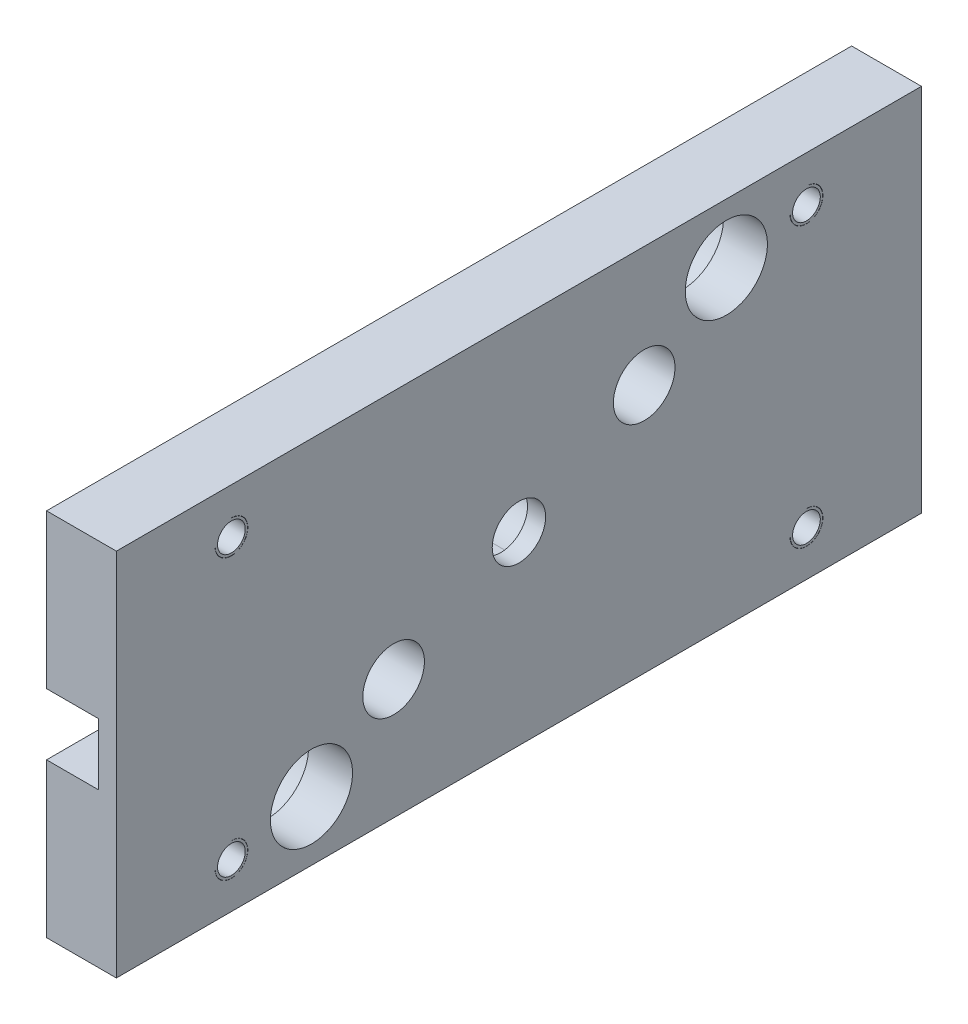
ISO-10303-21;
HEADER;
FILE_DESCRIPTION(('STEP AP214'),'2;1');
FILE_NAME('part.step','',(''),(''),'','','');
FILE_SCHEMA(('AUTOMOTIVE_DESIGN { 1 0 10303 214 1 1 1 1 }'));
ENDSEC;
DATA;
#1=APPLICATION_CONTEXT('core data for automotive mechanical design processes');
#2=APPLICATION_PROTOCOL_DEFINITION('international standard','automotive_design',2000,#1);
#3=PRODUCT_CONTEXT('',#1,'mechanical');
#4=PRODUCT('Part','Part','',(#3));
#5=PRODUCT_RELATED_PRODUCT_CATEGORY('part','',(#4));
#6=PRODUCT_DEFINITION_FORMATION('','',#4);
#7=PRODUCT_DEFINITION_CONTEXT('part definition',#1,'design');
#8=PRODUCT_DEFINITION('design','',#6,#7);
#9=PRODUCT_DEFINITION_SHAPE('','',#8);
#10=(LENGTH_UNIT() NAMED_UNIT(*) SI_UNIT(.MILLI.,.METRE.));
#11=(NAMED_UNIT(*) PLANE_ANGLE_UNIT() SI_UNIT($,.RADIAN.));
#12=(NAMED_UNIT(*) SI_UNIT($,.STERADIAN.) SOLID_ANGLE_UNIT());
#13=UNCERTAINTY_MEASURE_WITH_UNIT(LENGTH_MEASURE(1.E-05),#10,'distance_accuracy_value','');
#14=(GEOMETRIC_REPRESENTATION_CONTEXT(3) GLOBAL_UNCERTAINTY_ASSIGNED_CONTEXT((#13)) GLOBAL_UNIT_ASSIGNED_CONTEXT((#10,
#11,#12)) REPRESENTATION_CONTEXT('',''));
#15=CARTESIAN_POINT('',(0.,0.,0.));
#16=DIRECTION('',(0.,0.,1.));
#17=DIRECTION('',(1.,0.,0.));
#18=AXIS2_PLACEMENT_3D('',#15,#16,#17);
#19=CARTESIAN_POINT('',(-85.,0.,0.));
#20=DIRECTION('',(1.,0.,0.));
#21=DIRECTION('',(0.,0.,-1.));
#22=AXIS2_PLACEMENT_3D('',#19,#20,#21);
#23=PLANE('',#22);
#24=DIRECTION('',(0.,-1.,0.));
#25=VECTOR('',#24,1.);
#26=CARTESIAN_POINT('',(-85.0000000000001,45.,-98.0000000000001));
#27=LINE('',#26,#25);
#28=CARTESIAN_POINT('',(-85.0000000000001,45.,-98.0000000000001));
#29=VERTEX_POINT('',#28);
#30=CARTESIAN_POINT('',(-85.0000000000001,-45.,-98.0000000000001));
#31=VERTEX_POINT('',#30);
#32=EDGE_CURVE('E34',#29,#31,#27,.T.);
#33=ORIENTED_EDGE('',*,*,#32,.F.);
#34=DIRECTION('',(0.,0.,-1.));
#35=VECTOR('',#34,1.);
#36=CARTESIAN_POINT('',(-85.,45.,98.0000000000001));
#37=LINE('',#36,#35);
#38=CARTESIAN_POINT('',(-85.,45.,98.0000000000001));
#39=VERTEX_POINT('',#38);
#40=EDGE_CURVE('E323',#39,#29,#37,.T.);
#41=ORIENTED_EDGE('',*,*,#40,.F.);
#42=DIRECTION('',(0.,1.,0.));
#43=VECTOR('',#42,1.);
#44=CARTESIAN_POINT('',(-85.,-45.,98.0000000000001));
#45=LINE('',#44,#43);
#46=CARTESIAN_POINT('',(-85.,-45.,98.0000000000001));
#47=VERTEX_POINT('',#46);
#48=EDGE_CURVE('E317',#47,#39,#45,.T.);
#49=ORIENTED_EDGE('',*,*,#48,.F.);
#50=DIRECTION('',(0.,0.,1.));
#51=VECTOR('',#50,1.);
#52=CARTESIAN_POINT('',(-85.0000000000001,-45.,-98.0000000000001));
#53=LINE('',#52,#51);
#54=EDGE_CURVE('E435',#31,#47,#53,.T.);
#55=ORIENTED_EDGE('',*,*,#54,.F.);
#56=EDGE_LOOP('',(#33,#41,#49,#55));
#57=FACE_BOUND('',#56,.T.);
#58=CARTESIAN_POINT('',(-85.0000000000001,34.,-70.0000000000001));
#59=DIRECTION('',(-1.,0.,0.));
#60=DIRECTION('',(0.,0.,1.));
#61=AXIS2_PLACEMENT_3D('',#58,#59,#60);
#62=CIRCLE('',#61,3.375);
#63=CARTESIAN_POINT('',(-85.0000000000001,34.,-66.6250000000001));
#64=VERTEX_POINT('',#63);
#65=EDGE_CURVE('E9',#64,#64,#62,.T.);
#66=ORIENTED_EDGE('',*,*,#65,.T.);
#67=EDGE_LOOP('',(#66));
#68=FACE_BOUND('',#67,.T.);
#69=CARTESIAN_POINT('',(-85.0000000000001,34.,-70.0000000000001));
#70=DIRECTION('',(1.,0.,0.));
#71=DIRECTION('',(0.,1.,0.));
#72=AXIS2_PLACEMENT_3D('',#69,#70,#71);
#73=CIRCLE('',#72,3.95);
#74=CARTESIAN_POINT('',(-85.0000000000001,34.,-66.0500000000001));
#75=VERTEX_POINT('',#74);
#76=CARTESIAN_POINT('',(-85.0000000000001,37.95,-70.0000000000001));
#77=VERTEX_POINT('',#76);
#78=EDGE_CURVE('E25',#75,#77,#73,.T.);
#79=ORIENTED_EDGE('',*,*,#78,.T.);
#80=DIRECTION('',(0.,1.,0.));
#81=VECTOR('',#80,1.);
#82=CARTESIAN_POINT('',(-85.0000000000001,18.9875,-70.));
#83=LINE('',#82,#81);
#84=CARTESIAN_POINT('',(-85.0000000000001,38.,-70.0000000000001));
#85=VERTEX_POINT('',#84);
#86=EDGE_CURVE('E197',#77,#85,#83,.T.);
#87=ORIENTED_EDGE('',*,*,#86,.T.);
#88=CARTESIAN_POINT('',(-85.0000000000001,34.,-70.0000000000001));
#89=DIRECTION('',(-1.,0.,0.));
#90=DIRECTION('',(0.,1.,0.));
#91=AXIS2_PLACEMENT_3D('',#88,#89,#90);
#92=CIRCLE('',#91,4.);
#93=CARTESIAN_POINT('',(-85.0000000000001,34.,-66.0000000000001));
#94=VERTEX_POINT('',#93);
#95=EDGE_CURVE('E200',#85,#94,#92,.T.);
#96=ORIENTED_EDGE('',*,*,#95,.T.);
#97=DIRECTION('',(0.,0.,-1.));
#98=VECTOR('',#97,1.);
#99=CARTESIAN_POINT('',(-85.,34.,-33.0125));
#100=LINE('',#99,#98);
#101=EDGE_CURVE('E209',#94,#75,#100,.T.);
#102=ORIENTED_EDGE('',*,*,#101,.T.);
#103=EDGE_LOOP('',(#79,#87,#96,#102));
#104=FACE_BOUND('',#103,.T.);
#105=CARTESIAN_POINT('',(-85.,34.,70.0000000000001));
#106=DIRECTION('',(-1.,0.,0.));
#107=DIRECTION('',(0.,0.,1.));
#108=AXIS2_PLACEMENT_3D('',#105,#106,#107);
#109=CIRCLE('',#108,3.375);
#110=CARTESIAN_POINT('',(-85.,34.,73.3750000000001));
#111=VERTEX_POINT('',#110);
#112=EDGE_CURVE('E217',#111,#111,#109,.T.);
#113=ORIENTED_EDGE('',*,*,#112,.T.);
#114=EDGE_LOOP('',(#113));
#115=FACE_BOUND('',#114,.T.);
#116=DIRECTION('',(0.,0.,-1.));
#117=VECTOR('',#116,1.);
#118=CARTESIAN_POINT('',(-85.,34.,36.9875));
#119=LINE('',#118,#117);
#120=CARTESIAN_POINT('',(-85.,34.,74.0000000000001));
#121=VERTEX_POINT('',#120);
#122=CARTESIAN_POINT('',(-85.,34.,73.9500000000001));
#123=VERTEX_POINT('',#122);
#124=EDGE_CURVE('E353',#121,#123,#119,.T.);
#125=ORIENTED_EDGE('',*,*,#124,.T.);
#126=CARTESIAN_POINT('',(-85.,34.,70.0000000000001));
#127=DIRECTION('',(1.,0.,0.));
#128=DIRECTION('',(0.,1.,0.));
#129=AXIS2_PLACEMENT_3D('',#126,#127,#128);
#130=CIRCLE('',#129,3.95);
#131=CARTESIAN_POINT('',(-85.,37.95,70.));
#132=VERTEX_POINT('',#131);
#133=EDGE_CURVE('E369',#123,#132,#130,.T.);
#134=ORIENTED_EDGE('',*,*,#133,.T.);
#135=DIRECTION('',(0.,1.,0.));
#136=VECTOR('',#135,1.);
#137=CARTESIAN_POINT('',(-85.,18.9875,70.0000000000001));
#138=LINE('',#137,#136);
#139=CARTESIAN_POINT('',(-85.,38.,70.));
#140=VERTEX_POINT('',#139);
#141=EDGE_CURVE('E370',#132,#140,#138,.T.);
#142=ORIENTED_EDGE('',*,*,#141,.T.);
#143=CARTESIAN_POINT('',(-85.,34.,70.0000000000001));
#144=DIRECTION('',(-1.,0.,0.));
#145=DIRECTION('',(0.,1.,0.));
#146=AXIS2_PLACEMENT_3D('',#143,#144,#145);
#147=CIRCLE('',#146,4.);
#148=EDGE_CURVE('E357',#140,#121,#147,.T.);
#149=ORIENTED_EDGE('',*,*,#148,.T.);
#150=EDGE_LOOP('',(#125,#134,#142,#149));
#151=FACE_BOUND('',#150,.T.);
#152=CARTESIAN_POINT('',(-85.,-34.,70.0000000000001));
#153=DIRECTION('',(-1.,0.,0.));
#154=DIRECTION('',(0.,0.,1.));
#155=AXIS2_PLACEMENT_3D('',#152,#153,#154);
#156=CIRCLE('',#155,3.375);
#157=CARTESIAN_POINT('',(-85.,-34.,73.3750000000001));
#158=VERTEX_POINT('',#157);
#159=EDGE_CURVE('E358',#158,#158,#156,.T.);
#160=ORIENTED_EDGE('',*,*,#159,.T.);
#161=EDGE_LOOP('',(#160));
#162=FACE_BOUND('',#161,.T.);
#163=CARTESIAN_POINT('',(-85.,-34.,70.0000000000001));
#164=DIRECTION('',(1.,0.,0.));
#165=DIRECTION('',(0.,1.,0.));
#166=AXIS2_PLACEMENT_3D('',#163,#164,#165);
#167=CIRCLE('',#166,3.95);
#168=CARTESIAN_POINT('',(-85.,-34.,73.9500000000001));
#169=VERTEX_POINT('',#168);
#170=CARTESIAN_POINT('',(-85.,-30.05,70.0000000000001));
#171=VERTEX_POINT('',#170);
#172=EDGE_CURVE('E130',#169,#171,#167,.T.);
#173=ORIENTED_EDGE('',*,*,#172,.T.);
#174=DIRECTION('',(0.,1.,0.));
#175=VECTOR('',#174,1.);
#176=CARTESIAN_POINT('',(-85.,-15.0125,70.0000000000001));
#177=LINE('',#176,#175);
#178=CARTESIAN_POINT('',(-85.,-30.,70.0000000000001));
#179=VERTEX_POINT('',#178);
#180=EDGE_CURVE('E229',#171,#179,#177,.T.);
#181=ORIENTED_EDGE('',*,*,#180,.T.);
#182=CARTESIAN_POINT('',(-85.,-34.,70.0000000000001));
#183=DIRECTION('',(-1.,0.,0.));
#184=DIRECTION('',(0.,1.,0.));
#185=AXIS2_PLACEMENT_3D('',#182,#183,#184);
#186=CIRCLE('',#185,4.);
#187=CARTESIAN_POINT('',(-85.,-34.,74.0000000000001));
#188=VERTEX_POINT('',#187);
#189=EDGE_CURVE('E220',#179,#188,#186,.T.);
#190=ORIENTED_EDGE('',*,*,#189,.T.);
#191=DIRECTION('',(0.,0.,-1.));
#192=VECTOR('',#191,1.);
#193=CARTESIAN_POINT('',(-85.,-34.,36.9875));
#194=LINE('',#193,#192);
#195=EDGE_CURVE('E376',#188,#169,#194,.T.);
#196=ORIENTED_EDGE('',*,*,#195,.T.);
#197=EDGE_LOOP('',(#173,#181,#190,#196));
#198=FACE_BOUND('',#197,.T.);
#199=CARTESIAN_POINT('',(-85.0000000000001,-34.,-70.0000000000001));
#200=DIRECTION('',(-1.,0.,0.));
#201=DIRECTION('',(0.,0.,1.));
#202=AXIS2_PLACEMENT_3D('',#199,#200,#201);
#203=CIRCLE('',#202,3.375);
#204=CARTESIAN_POINT('',(-85.0000000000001,-34.,-66.6250000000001));
#205=VERTEX_POINT('',#204);
#206=EDGE_CURVE('E260',#205,#205,#203,.T.);
#207=ORIENTED_EDGE('',*,*,#206,.T.);
#208=EDGE_LOOP('',(#207));
#209=FACE_BOUND('',#208,.T.);
#210=CARTESIAN_POINT('',(-85.0000000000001,-34.,-70.0000000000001));
#211=DIRECTION('',(1.,0.,0.));
#212=DIRECTION('',(0.,1.,0.));
#213=AXIS2_PLACEMENT_3D('',#210,#211,#212);
#214=CIRCLE('',#213,3.95);
#215=CARTESIAN_POINT('',(-85.0000000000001,-34.,-66.0500000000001));
#216=VERTEX_POINT('',#215);
#217=CARTESIAN_POINT('',(-85.0000000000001,-30.05,-70.));
#218=VERTEX_POINT('',#217);
#219=EDGE_CURVE('E257',#216,#218,#214,.T.);
#220=ORIENTED_EDGE('',*,*,#219,.T.);
#221=DIRECTION('',(0.,1.,0.));
#222=VECTOR('',#221,1.);
#223=CARTESIAN_POINT('',(-85.0000000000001,-15.0125,-70.0000000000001));
#224=LINE('',#223,#222);
#225=CARTESIAN_POINT('',(-85.0000000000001,-30.,-70.));
#226=VERTEX_POINT('',#225);
#227=EDGE_CURVE('E261',#218,#226,#224,.T.);
#228=ORIENTED_EDGE('',*,*,#227,.T.);
#229=CARTESIAN_POINT('',(-85.0000000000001,-34.,-70.0000000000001));
#230=DIRECTION('',(-1.,0.,0.));
#231=DIRECTION('',(0.,1.,0.));
#232=AXIS2_PLACEMENT_3D('',#229,#230,#231);
#233=CIRCLE('',#232,4.);
#234=CARTESIAN_POINT('',(-85.0000000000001,-34.,-66.0000000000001));
#235=VERTEX_POINT('',#234);
#236=EDGE_CURVE('E170',#226,#235,#233,.T.);
#237=ORIENTED_EDGE('',*,*,#236,.T.);
#238=DIRECTION('',(0.,0.,-1.));
#239=VECTOR('',#238,1.);
#240=CARTESIAN_POINT('',(-85.,-34.,-33.0125));
#241=LINE('',#240,#239);
#242=EDGE_CURVE('E166',#235,#216,#241,.T.);
#243=ORIENTED_EDGE('',*,*,#242,.T.);
#244=EDGE_LOOP('',(#220,#228,#237,#243));
#245=FACE_BOUND('',#244,.T.);
#246=CARTESIAN_POINT('',(-85.,15.75,-30.5));
#247=DIRECTION('',(-1.,0.,0.));
#248=DIRECTION('',(0.,0.,1.));
#249=AXIS2_PLACEMENT_3D('',#246,#247,#248);
#250=CIRCLE('',#249,7.5);
#251=CARTESIAN_POINT('',(-85.,15.75,-23.));
#252=VERTEX_POINT('',#251);
#253=EDGE_CURVE('E171',#252,#252,#250,.T.);
#254=ORIENTED_EDGE('',*,*,#253,.T.);
#255=EDGE_LOOP('',(#254));
#256=FACE_BOUND('',#255,.T.);
#257=CARTESIAN_POINT('',(-85.,-15.75,30.5));
#258=DIRECTION('',(-1.,0.,0.));
#259=DIRECTION('',(0.,0.,1.));
#260=AXIS2_PLACEMENT_3D('',#257,#258,#259);
#261=CIRCLE('',#260,7.5);
#262=CARTESIAN_POINT('',(-85.,-15.75,38.));
#263=VERTEX_POINT('',#262);
#264=EDGE_CURVE('E403',#263,#263,#261,.T.);
#265=ORIENTED_EDGE('',*,*,#264,.T.);
#266=EDGE_LOOP('',(#265));
#267=FACE_BOUND('',#266,.T.);
#268=CARTESIAN_POINT('',(-85.,30.5,-50.5000000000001));
#269=DIRECTION('',(-1.,0.,0.));
#270=DIRECTION('',(0.,0.,1.));
#271=AXIS2_PLACEMENT_3D('',#268,#269,#270);
#272=CIRCLE('',#271,10.);
#273=CARTESIAN_POINT('',(-85.,30.5,-40.5000000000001));
#274=VERTEX_POINT('',#273);
#275=EDGE_CURVE('E346',#274,#274,#272,.T.);
#276=ORIENTED_EDGE('',*,*,#275,.T.);
#277=EDGE_LOOP('',(#276));
#278=FACE_BOUND('',#277,.T.);
#279=CARTESIAN_POINT('',(-85.,-30.5,50.5000000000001));
#280=DIRECTION('',(-1.,0.,0.));
#281=DIRECTION('',(0.,0.,1.));
#282=AXIS2_PLACEMENT_3D('',#279,#280,#281);
#283=CIRCLE('',#282,10.);
#284=CARTESIAN_POINT('',(-85.,-30.5,60.5000000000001));
#285=VERTEX_POINT('',#284);
#286=EDGE_CURVE('E342',#285,#285,#283,.T.);
#287=ORIENTED_EDGE('',*,*,#286,.T.);
#288=EDGE_LOOP('',(#287));
#289=FACE_BOUND('',#288,.T.);
#290=CARTESIAN_POINT('',(-85.,0.,0.));
#291=DIRECTION('',(-1.,0.,0.));
#292=DIRECTION('',(0.,0.,1.));
#293=AXIS2_PLACEMENT_3D('',#290,#291,#292);
#294=CIRCLE('',#293,6.5);
#295=CARTESIAN_POINT('',(-85.,0.,6.50000000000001));
#296=VERTEX_POINT('',#295);
#297=EDGE_CURVE('E280',#296,#296,#294,.T.);
#298=ORIENTED_EDGE('',*,*,#297,.T.);
#299=EDGE_LOOP('',(#298));
#300=FACE_BOUND('',#299,.T.);
#301=ADVANCED_FACE('F14',(#57,#68,#104,#115,#151,#162,#198,#209,#245,#256,#267,#278,#289,#300),
#23,.T.);
#302=CARTESIAN_POINT('',(-102.,0.,0.));
#303=DIRECTION('',(-1.,0.,0.));
#304=DIRECTION('',(0.,0.,1.));
#305=AXIS2_PLACEMENT_3D('',#302,#303,#304);
#306=PLANE('',#305);
#307=CARTESIAN_POINT('',(-102.,34.,-70.0000000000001));
#308=DIRECTION('',(1.,0.,0.));
#309=DIRECTION('',(0.,0.,1.));
#310=AXIS2_PLACEMENT_3D('',#307,#308,#309);
#311=CIRCLE('',#310,3.375);
#312=CARTESIAN_POINT('',(-102.,34.,-66.6250000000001));
#313=VERTEX_POINT('',#312);
#314=EDGE_CURVE('E276',#313,#313,#311,.T.);
#315=ORIENTED_EDGE('',*,*,#314,.T.);
#316=EDGE_LOOP('',(#315));
#317=FACE_BOUND('',#316,.T.);
#318=CARTESIAN_POINT('',(-102.,34.,-70.0000000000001));
#319=DIRECTION('',(-1.,0.,0.));
#320=DIRECTION('',(0.,1.,0.));
#321=AXIS2_PLACEMENT_3D('',#318,#319,#320);
#322=CIRCLE('',#321,3.95);
#323=CARTESIAN_POINT('',(-102.,37.95,-70.0000000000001));
#324=VERTEX_POINT('',#323);
#325=CARTESIAN_POINT('',(-102.,34.,-66.0500000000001));
#326=VERTEX_POINT('',#325);
#327=EDGE_CURVE('E195',#324,#326,#322,.T.);
#328=ORIENTED_EDGE('',*,*,#327,.T.);
#329=DIRECTION('',(0.,0.,1.));
#330=VECTOR('',#329,1.);
#331=CARTESIAN_POINT('',(-102.,34.,-33.0125));
#332=LINE('',#331,#330);
#333=CARTESIAN_POINT('',(-102.,34.,-66.0000000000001));
#334=VERTEX_POINT('',#333);
#335=EDGE_CURVE('E192',#326,#334,#332,.T.);
#336=ORIENTED_EDGE('',*,*,#335,.T.);
#337=CARTESIAN_POINT('',(-102.,34.,-70.0000000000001));
#338=DIRECTION('',(1.,0.,0.));
#339=DIRECTION('',(0.,1.,0.));
#340=AXIS2_PLACEMENT_3D('',#337,#338,#339);
#341=CIRCLE('',#340,4.);
#342=CARTESIAN_POINT('',(-102.,38.,-70.0000000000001));
#343=VERTEX_POINT('',#342);
#344=EDGE_CURVE('E196',#334,#343,#341,.T.);
#345=ORIENTED_EDGE('',*,*,#344,.T.);
#346=DIRECTION('',(0.,-1.,0.));
#347=VECTOR('',#346,1.);
#348=CARTESIAN_POINT('',(-102.,18.9875,-70.));
#349=LINE('',#348,#347);
#350=EDGE_CURVE('E335',#343,#324,#349,.T.);
#351=ORIENTED_EDGE('',*,*,#350,.T.);
#352=EDGE_LOOP('',(#328,#336,#345,#351));
#353=FACE_BOUND('',#352,.T.);
#354=CARTESIAN_POINT('',(-102.,34.,70.0000000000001));
#355=DIRECTION('',(1.,0.,0.));
#356=DIRECTION('',(0.,0.,1.));
#357=AXIS2_PLACEMENT_3D('',#354,#355,#356);
#358=CIRCLE('',#357,3.375);
#359=CARTESIAN_POINT('',(-102.,34.,73.3750000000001));
#360=VERTEX_POINT('',#359);
#361=EDGE_CURVE('E331',#360,#360,#358,.T.);
#362=ORIENTED_EDGE('',*,*,#361,.T.);
#363=EDGE_LOOP('',(#362));
#364=FACE_BOUND('',#363,.T.);
#365=CARTESIAN_POINT('',(-102.,34.,70.0000000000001));
#366=DIRECTION('',(-1.,0.,0.));
#367=DIRECTION('',(0.,1.,0.));
#368=AXIS2_PLACEMENT_3D('',#365,#366,#367);
#369=CIRCLE('',#368,3.95);
#370=CARTESIAN_POINT('',(-102.,37.95,70.0000000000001));
#371=VERTEX_POINT('',#370);
#372=CARTESIAN_POINT('',(-102.,34.,73.9500000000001));
#373=VERTEX_POINT('',#372);
#374=EDGE_CURVE('E288',#371,#373,#369,.T.);
#375=ORIENTED_EDGE('',*,*,#374,.T.);
#376=DIRECTION('',(0.,0.,1.));
#377=VECTOR('',#376,1.);
#378=CARTESIAN_POINT('',(-102.,34.,36.9875));
#379=LINE('',#378,#377);
#380=CARTESIAN_POINT('',(-102.,34.,74.0000000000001));
#381=VERTEX_POINT('',#380);
#382=EDGE_CURVE('E284',#373,#381,#379,.T.);
#383=ORIENTED_EDGE('',*,*,#382,.T.);
#384=CARTESIAN_POINT('',(-102.,34.,70.0000000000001));
#385=DIRECTION('',(1.,0.,0.));
#386=DIRECTION('',(0.,1.,0.));
#387=AXIS2_PLACEMENT_3D('',#384,#385,#386);
#388=CIRCLE('',#387,4.);
#389=CARTESIAN_POINT('',(-102.,38.,70.0000000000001));
#390=VERTEX_POINT('',#389);
#391=EDGE_CURVE('E289',#381,#390,#388,.T.);
#392=ORIENTED_EDGE('',*,*,#391,.T.);
#393=DIRECTION('',(0.,-1.,0.));
#394=VECTOR('',#393,1.);
#395=CARTESIAN_POINT('',(-102.,18.9875,70.0000000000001));
#396=LINE('',#395,#394);
#397=EDGE_CURVE('E302',#390,#371,#396,.T.);
#398=ORIENTED_EDGE('',*,*,#397,.T.);
#399=EDGE_LOOP('',(#375,#383,#392,#398));
#400=FACE_BOUND('',#399,.T.);
#401=CARTESIAN_POINT('',(-102.,-34.,70.0000000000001));
#402=DIRECTION('',(1.,0.,0.));
#403=DIRECTION('',(0.,0.,1.));
#404=AXIS2_PLACEMENT_3D('',#401,#402,#403);
#405=CIRCLE('',#404,3.375);
#406=CARTESIAN_POINT('',(-102.,-34.,73.3750000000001));
#407=VERTEX_POINT('',#406);
#408=EDGE_CURVE('E149',#407,#407,#405,.T.);
#409=ORIENTED_EDGE('',*,*,#408,.T.);
#410=EDGE_LOOP('',(#409));
#411=FACE_BOUND('',#410,.T.);
#412=DIRECTION('',(0.,-1.,0.));
#413=VECTOR('',#412,1.);
#414=CARTESIAN_POINT('',(-102.,-15.0125,70.0000000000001));
#415=LINE('',#414,#413);
#416=CARTESIAN_POINT('',(-102.,-30.,70.0000000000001));
#417=VERTEX_POINT('',#416);
#418=CARTESIAN_POINT('',(-102.,-30.05,70.0000000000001));
#419=VERTEX_POINT('',#418);
#420=EDGE_CURVE('E147',#417,#419,#415,.T.);
#421=ORIENTED_EDGE('',*,*,#420,.T.);
#422=CARTESIAN_POINT('',(-102.,-34.,70.0000000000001));
#423=DIRECTION('',(-1.,0.,0.));
#424=DIRECTION('',(0.,1.,0.));
#425=AXIS2_PLACEMENT_3D('',#422,#423,#424);
#426=CIRCLE('',#425,3.95);
#427=CARTESIAN_POINT('',(-102.,-34.,73.9500000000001));
#428=VERTEX_POINT('',#427);
#429=EDGE_CURVE('E128',#419,#428,#426,.T.);
#430=ORIENTED_EDGE('',*,*,#429,.T.);
#431=DIRECTION('',(0.,0.,1.));
#432=VECTOR('',#431,1.);
#433=CARTESIAN_POINT('',(-102.,-34.,36.9875));
#434=LINE('',#433,#432);
#435=CARTESIAN_POINT('',(-102.,-34.,74.0000000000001));
#436=VERTEX_POINT('',#435);
#437=EDGE_CURVE('E145',#428,#436,#434,.T.);
#438=ORIENTED_EDGE('',*,*,#437,.T.);
#439=CARTESIAN_POINT('',(-102.,-34.,70.0000000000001));
#440=DIRECTION('',(1.,0.,0.));
#441=DIRECTION('',(0.,1.,0.));
#442=AXIS2_PLACEMENT_3D('',#439,#440,#441);
#443=CIRCLE('',#442,4.);
#444=EDGE_CURVE('E155',#436,#417,#443,.T.);
#445=ORIENTED_EDGE('',*,*,#444,.T.);
#446=EDGE_LOOP('',(#421,#430,#438,#445));
#447=FACE_BOUND('',#446,.T.);
#448=CARTESIAN_POINT('',(-102.,-34.,-70.));
#449=DIRECTION('',(1.,0.,0.));
#450=DIRECTION('',(0.,0.,1.));
#451=AXIS2_PLACEMENT_3D('',#448,#449,#450);
#452=CIRCLE('',#451,3.375);
#453=CARTESIAN_POINT('',(-102.,-34.,-66.625));
#454=VERTEX_POINT('',#453);
#455=EDGE_CURVE('E273',#454,#454,#452,.T.);
#456=ORIENTED_EDGE('',*,*,#455,.T.);
#457=EDGE_LOOP('',(#456));
#458=FACE_BOUND('',#457,.T.);
#459=DIRECTION('',(0.,-1.,0.));
#460=VECTOR('',#459,1.);
#461=CARTESIAN_POINT('',(-102.,-15.0125,-70.0000000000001));
#462=LINE('',#461,#460);
#463=CARTESIAN_POINT('',(-102.,-30.,-70.));
#464=VERTEX_POINT('',#463);
#465=CARTESIAN_POINT('',(-102.,-30.05,-70.));
#466=VERTEX_POINT('',#465);
#467=EDGE_CURVE('E298',#464,#466,#462,.T.);
#468=ORIENTED_EDGE('',*,*,#467,.T.);
#469=CARTESIAN_POINT('',(-102.,-34.,-70.));
#470=DIRECTION('',(-1.,0.,0.));
#471=DIRECTION('',(0.,1.,0.));
#472=AXIS2_PLACEMENT_3D('',#469,#470,#471);
#473=CIRCLE('',#472,3.95);
#474=CARTESIAN_POINT('',(-102.,-34.,-66.05));
#475=VERTEX_POINT('',#474);
#476=EDGE_CURVE('E270',#466,#475,#473,.T.);
#477=ORIENTED_EDGE('',*,*,#476,.T.);
#478=DIRECTION('',(0.,0.,1.));
#479=VECTOR('',#478,1.);
#480=CARTESIAN_POINT('',(-102.,-34.,-33.0125));
#481=LINE('',#480,#479);
#482=CARTESIAN_POINT('',(-102.,-34.,-66.));
#483=VERTEX_POINT('',#482);
#484=EDGE_CURVE('E274',#475,#483,#481,.T.);
#485=ORIENTED_EDGE('',*,*,#484,.T.);
#486=CARTESIAN_POINT('',(-102.,-34.,-70.));
#487=DIRECTION('',(1.,0.,0.));
#488=DIRECTION('',(0.,1.,0.));
#489=AXIS2_PLACEMENT_3D('',#486,#487,#488);
#490=CIRCLE('',#489,4.);
#491=EDGE_CURVE('E362',#483,#464,#490,.T.);
#492=ORIENTED_EDGE('',*,*,#491,.T.);
#493=EDGE_LOOP('',(#468,#477,#485,#492));
#494=FACE_BOUND('',#493,.T.);
#495=CARTESIAN_POINT('',(-102.,15.75,-30.5));
#496=DIRECTION('',(1.,0.,0.));
#497=DIRECTION('',(0.,0.,1.));
#498=AXIS2_PLACEMENT_3D('',#495,#496,#497);
#499=CIRCLE('',#498,7.5);
#500=CARTESIAN_POINT('',(-102.,15.75,-23.));
#501=VERTEX_POINT('',#500);
#502=EDGE_CURVE('E294',#501,#501,#499,.T.);
#503=ORIENTED_EDGE('',*,*,#502,.T.);
#504=EDGE_LOOP('',(#503));
#505=FACE_BOUND('',#504,.T.);
#506=CARTESIAN_POINT('',(-102.,-15.75,30.5));
#507=DIRECTION('',(1.,0.,0.));
#508=DIRECTION('',(0.,0.,1.));
#509=AXIS2_PLACEMENT_3D('',#506,#507,#508);
#510=CIRCLE('',#509,7.5);
#511=CARTESIAN_POINT('',(-102.,-15.75,38.));
#512=VERTEX_POINT('',#511);
#513=EDGE_CURVE('E256',#512,#512,#510,.T.);
#514=ORIENTED_EDGE('',*,*,#513,.T.);
#515=EDGE_LOOP('',(#514));
#516=FACE_BOUND('',#515,.T.);
#517=CARTESIAN_POINT('',(-102.,30.5,-50.5000000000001));
#518=DIRECTION('',(1.,0.,0.));
#519=DIRECTION('',(0.,0.,1.));
#520=AXIS2_PLACEMENT_3D('',#517,#518,#519);
#521=CIRCLE('',#520,13.);
#522=CARTESIAN_POINT('',(-102.,30.5,-37.5000000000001));
#523=VERTEX_POINT('',#522);
#524=EDGE_CURVE('E176',#523,#523,#521,.T.);
#525=ORIENTED_EDGE('',*,*,#524,.T.);
#526=EDGE_LOOP('',(#525));
#527=FACE_BOUND('',#526,.T.);
#528=CARTESIAN_POINT('',(-102.,-30.5,50.5000000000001));
#529=DIRECTION('',(1.,0.,0.));
#530=DIRECTION('',(0.,0.,1.));
#531=AXIS2_PLACEMENT_3D('',#528,#529,#530);
#532=CIRCLE('',#531,13.);
#533=CARTESIAN_POINT('',(-102.,-30.5,63.5000000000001));
#534=VERTEX_POINT('',#533);
#535=EDGE_CURVE('E172',#534,#534,#532,.T.);
#536=ORIENTED_EDGE('',*,*,#535,.T.);
#537=EDGE_LOOP('',(#536));
#538=FACE_BOUND('',#537,.T.);
#539=DIRECTION('',(0.,0.,1.));
#540=VECTOR('',#539,1.);
#541=CARTESIAN_POINT('',(-102.,7.50000000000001,49.0000000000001));
#542=LINE('',#541,#540);
#543=CARTESIAN_POINT('',(-102.,7.5,-2.));
#544=VERTEX_POINT('',#543);
#545=CARTESIAN_POINT('',(-102.,7.5,98.0000000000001));
#546=VERTEX_POINT('',#545);
#547=EDGE_CURVE('E177',#544,#546,#542,.T.);
#548=ORIENTED_EDGE('',*,*,#547,.T.);
#549=DIRECTION('',(0.,1.,0.));
#550=VECTOR('',#549,1.);
#551=CARTESIAN_POINT('',(-102.,-45.,98.0000000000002));
#552=LINE('',#551,#550);
#553=CARTESIAN_POINT('',(-102.,45.,98.0000000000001));
#554=VERTEX_POINT('',#553);
#555=EDGE_CURVE('E293',#546,#554,#552,.T.);
#556=ORIENTED_EDGE('',*,*,#555,.T.);
#557=DIRECTION('',(0.,0.,-1.));
#558=VECTOR('',#557,1.);
#559=CARTESIAN_POINT('',(-102.,45.,98.0000000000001));
#560=LINE('',#559,#558);
#561=CARTESIAN_POINT('',(-102.,45.,-98.0000000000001));
#562=VERTEX_POINT('',#561);
#563=EDGE_CURVE('E227',#554,#562,#560,.T.);
#564=ORIENTED_EDGE('',*,*,#563,.T.);
#565=DIRECTION('',(0.,-1.,0.));
#566=VECTOR('',#565,1.);
#567=CARTESIAN_POINT('',(-102.,45.,-98.0000000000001));
#568=LINE('',#567,#566);
#569=CARTESIAN_POINT('',(-102.,-45.,-98.0000000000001));
#570=VERTEX_POINT('',#569);
#571=EDGE_CURVE('E223',#562,#570,#568,.T.);
#572=ORIENTED_EDGE('',*,*,#571,.T.);
#573=DIRECTION('',(0.,0.,1.));
#574=VECTOR('',#573,1.);
#575=CARTESIAN_POINT('',(-102.,-45.,-98.0000000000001));
#576=LINE('',#575,#574);
#577=CARTESIAN_POINT('',(-102.,-45.,98.0000000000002));
#578=VERTEX_POINT('',#577);
#579=EDGE_CURVE('E228',#570,#578,#576,.T.);
#580=ORIENTED_EDGE('',*,*,#579,.T.);
#581=DIRECTION('',(0.,1.,0.));
#582=VECTOR('',#581,1.);
#583=CARTESIAN_POINT('',(-102.,-45.,98.0000000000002));
#584=LINE('',#583,#582);
#585=CARTESIAN_POINT('',(-102.,-7.5,98.0000000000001));
#586=VERTEX_POINT('',#585);
#587=EDGE_CURVE('E242',#578,#586,#584,.T.);
#588=ORIENTED_EDGE('',*,*,#587,.T.);
#589=DIRECTION('',(0.,0.,-1.));
#590=VECTOR('',#589,1.);
#591=CARTESIAN_POINT('',(-102.,-7.50000000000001,-0.999999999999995));
#592=LINE('',#591,#590);
#593=CARTESIAN_POINT('',(-102.,-7.50000000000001,-2.));
#594=VERTEX_POINT('',#593);
#595=EDGE_CURVE('E246',#586,#594,#592,.T.);
#596=ORIENTED_EDGE('',*,*,#595,.T.);
#597=CARTESIAN_POINT('',(-102.,0.,-2.));
#598=DIRECTION('',(1.,0.,0.));
#599=DIRECTION('',(0.,0.,1.));
#600=AXIS2_PLACEMENT_3D('',#597,#598,#599);
#601=CIRCLE('',#600,7.5);
#602=EDGE_CURVE('E319',#594,#544,#601,.T.);
#603=ORIENTED_EDGE('',*,*,#602,.T.);
#604=EDGE_LOOP('',(#548,#556,#564,#572,#580,#588,#596,#603));
#605=FACE_BOUND('',#604,.T.);
#606=ADVANCED_FACE('F142',(#317,#353,#364,#400,#411,#447,#458,#494,#505,#516,#527,#538,#605),
#306,.T.);
#607=CARTESIAN_POINT('',(-102.,45.,98.0000000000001));
#608=DIRECTION('',(0.,1.,0.));
#609=DIRECTION('',(0.,0.,1.));
#610=AXIS2_PLACEMENT_3D('',#607,#608,#609);
#611=PLANE('',#610);
#612=ORIENTED_EDGE('',*,*,#40,.T.);
#613=DIRECTION('',(1.,0.,0.));
#614=VECTOR('',#613,1.);
#615=CARTESIAN_POINT('',(-102.,45.,-98.0000000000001));
#616=LINE('',#615,#614);
#617=EDGE_CURVE('E188',#562,#29,#616,.T.);
#618=ORIENTED_EDGE('',*,*,#617,.F.);
#619=ORIENTED_EDGE('',*,*,#563,.F.);
#620=DIRECTION('',(1.,0.,0.));
#621=VECTOR('',#620,1.);
#622=CARTESIAN_POINT('',(-102.,45.,98.0000000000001));
#623=LINE('',#622,#621);
#624=EDGE_CURVE('E460',#554,#39,#623,.T.);
#625=ORIENTED_EDGE('',*,*,#624,.T.);
#626=EDGE_LOOP('',(#612,#618,#619,#625));
#627=FACE_BOUND('',#626,.T.);
#628=ADVANCED_FACE('F538',(#627),#611,.T.);
#629=CARTESIAN_POINT('',(-102.,-45.,-98.0000000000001));
#630=DIRECTION('',(0.,-1.,0.));
#631=DIRECTION('',(0.,0.,-1.));
#632=AXIS2_PLACEMENT_3D('',#629,#630,#631);
#633=PLANE('',#632);
#634=ORIENTED_EDGE('',*,*,#54,.T.);
#635=DIRECTION('',(1.,0.,0.));
#636=VECTOR('',#635,1.);
#637=CARTESIAN_POINT('',(-102.,-45.,98.0000000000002));
#638=LINE('',#637,#636);
#639=EDGE_CURVE('E406',#578,#47,#638,.T.);
#640=ORIENTED_EDGE('',*,*,#639,.F.);
#641=ORIENTED_EDGE('',*,*,#579,.F.);
#642=DIRECTION('',(1.,0.,0.));
#643=VECTOR('',#642,1.);
#644=CARTESIAN_POINT('',(-102.,-45.,-98.0000000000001));
#645=LINE('',#644,#643);
#646=EDGE_CURVE('E310',#570,#31,#645,.T.);
#647=ORIENTED_EDGE('',*,*,#646,.T.);
#648=EDGE_LOOP('',(#634,#640,#641,#647));
#649=FACE_BOUND('',#648,.T.);
#650=ADVANCED_FACE('F602',(#649),#633,.T.);
#651=CARTESIAN_POINT('',(-102.,45.,-98.0000000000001));
#652=DIRECTION('',(0.,0.,-1.));
#653=DIRECTION('',(-1.,0.,0.));
#654=AXIS2_PLACEMENT_3D('',#651,#652,#653);
#655=PLANE('',#654);
#656=ORIENTED_EDGE('',*,*,#32,.T.);
#657=ORIENTED_EDGE('',*,*,#646,.F.);
#658=ORIENTED_EDGE('',*,*,#571,.F.);
#659=ORIENTED_EDGE('',*,*,#617,.T.);
#660=EDGE_LOOP('',(#656,#657,#658,#659));
#661=FACE_BOUND('',#660,.T.);
#662=ADVANCED_FACE('F599',(#661),#655,.T.);
#663=CARTESIAN_POINT('',(-93.5,34.,-70.0000000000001));
#664=DIRECTION('',(1.,0.,0.));
#665=DIRECTION('',(0.,0.,-1.));
#666=AXIS2_PLACEMENT_3D('',#663,#664,#665);
#667=CYLINDRICAL_SURFACE('',#666,3.375);
#668=ORIENTED_EDGE('',*,*,#314,.F.);
#669=EDGE_LOOP('',(#668));
#670=FACE_BOUND('',#669,.T.);
#671=ORIENTED_EDGE('',*,*,#65,.F.);
#672=EDGE_LOOP('',(#671));
#673=FACE_BOUND('',#672,.T.);
#674=ADVANCED_FACE('F675',(#670,#673),#667,.F.);
#675=CARTESIAN_POINT('',(-93.5,34.,-66.0250000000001));
#676=DIRECTION('',(0.,-1.,0.));
#677=DIRECTION('',(0.,0.,-1.));
#678=AXIS2_PLACEMENT_3D('',#675,#676,#677);
#679=PLANE('',#678);
#680=DIRECTION('',(-1.,0.,0.));
#681=VECTOR('',#680,1.);
#682=CARTESIAN_POINT('',(-102.,34.,-66.0000000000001));
#683=LINE('',#682,#681);
#684=EDGE_CURVE('E18',#94,#334,#683,.T.);
#685=ORIENTED_EDGE('',*,*,#684,.T.);
#686=ORIENTED_EDGE('',*,*,#335,.F.);
#687=DIRECTION('',(1.,0.,0.));
#688=VECTOR('',#687,1.);
#689=CARTESIAN_POINT('',(-85.0000000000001,34.,-66.0500000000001));
#690=LINE('',#689,#688);
#691=EDGE_CURVE('E324',#326,#75,#690,.T.);
#692=ORIENTED_EDGE('',*,*,#691,.T.);
#693=ORIENTED_EDGE('',*,*,#101,.F.);
#694=EDGE_LOOP('',(#685,#686,#692,#693));
#695=FACE_BOUND('',#694,.T.);
#696=ADVANCED_FACE('F678',(#695),#679,.T.);
#697=CARTESIAN_POINT('',(-93.5,37.975,-70.0000000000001));
#698=DIRECTION('',(0.,0.,-1.));
#699=DIRECTION('',(-1.,0.,0.));
#700=AXIS2_PLACEMENT_3D('',#697,#698,#699);
#701=PLANE('',#700);
#702=ORIENTED_EDGE('',*,*,#86,.F.);
#703=DIRECTION('',(-1.,0.,0.));
#704=VECTOR('',#703,1.);
#705=CARTESIAN_POINT('',(-85.0000000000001,37.95,-70.0000000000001));
#706=LINE('',#705,#704);
#707=EDGE_CURVE('E306',#77,#324,#706,.T.);
#708=ORIENTED_EDGE('',*,*,#707,.T.);
#709=ORIENTED_EDGE('',*,*,#350,.F.);
#710=DIRECTION('',(1.,0.,0.));
#711=VECTOR('',#710,1.);
#712=CARTESIAN_POINT('',(-102.,38.,-70.0000000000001));
#713=LINE('',#712,#711);
#714=EDGE_CURVE('E303',#343,#85,#713,.T.);
#715=ORIENTED_EDGE('',*,*,#714,.T.);
#716=EDGE_LOOP('',(#702,#708,#709,#715));
#717=FACE_BOUND('',#716,.T.);
#718=ADVANCED_FACE('F925',(#717),#701,.T.);
#719=CARTESIAN_POINT('',(-93.5,34.,-70.0000000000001));
#720=DIRECTION('',(1.,0.,0.));
#721=DIRECTION('',(0.,0.,-1.));
#722=AXIS2_PLACEMENT_3D('',#719,#720,#721);
#723=CYLINDRICAL_SURFACE('',#722,3.95);
#724=ORIENTED_EDGE('',*,*,#707,.F.);
#725=ORIENTED_EDGE('',*,*,#78,.F.);
#726=ORIENTED_EDGE('',*,*,#691,.F.);
#727=ORIENTED_EDGE('',*,*,#327,.F.);
#728=EDGE_LOOP('',(#724,#725,#726,#727));
#729=FACE_BOUND('',#728,.T.);
#730=ADVANCED_FACE('F684',(#729),#723,.T.);
#731=CARTESIAN_POINT('',(-93.5,34.,-70.0000000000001));
#732=DIRECTION('',(1.,0.,0.));
#733=DIRECTION('',(0.,0.,-1.));
#734=AXIS2_PLACEMENT_3D('',#731,#732,#733);
#735=CYLINDRICAL_SURFACE('',#734,4.);
#736=ORIENTED_EDGE('',*,*,#684,.F.);
#737=ORIENTED_EDGE('',*,*,#95,.F.);
#738=ORIENTED_EDGE('',*,*,#714,.F.);
#739=ORIENTED_EDGE('',*,*,#344,.F.);
#740=EDGE_LOOP('',(#736,#737,#738,#739));
#741=FACE_BOUND('',#740,.T.);
#742=ADVANCED_FACE('F680',(#741),#735,.F.);
#743=CARTESIAN_POINT('',(-93.4999999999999,34.,70.0000000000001));
#744=DIRECTION('',(1.,0.,0.));
#745=DIRECTION('',(0.,0.,-1.));
#746=AXIS2_PLACEMENT_3D('',#743,#744,#745);
#747=CYLINDRICAL_SURFACE('',#746,3.375);
#748=ORIENTED_EDGE('',*,*,#361,.F.);
#749=EDGE_LOOP('',(#748));
#750=FACE_BOUND('',#749,.T.);
#751=ORIENTED_EDGE('',*,*,#112,.F.);
#752=EDGE_LOOP('',(#751));
#753=FACE_BOUND('',#752,.T.);
#754=ADVANCED_FACE('F683',(#750,#753),#747,.F.);
#755=CARTESIAN_POINT('',(-93.4999999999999,34.,73.9750000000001));
#756=DIRECTION('',(0.,-1.,0.));
#757=DIRECTION('',(0.,0.,-1.));
#758=AXIS2_PLACEMENT_3D('',#755,#756,#757);
#759=PLANE('',#758);
#760=DIRECTION('',(-1.,0.,0.));
#761=VECTOR('',#760,1.);
#762=CARTESIAN_POINT('',(-102.,34.,74.0000000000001));
#763=LINE('',#762,#761);
#764=EDGE_CURVE('E307',#121,#381,#763,.T.);
#765=ORIENTED_EDGE('',*,*,#764,.T.);
#766=ORIENTED_EDGE('',*,*,#382,.F.);
#767=DIRECTION('',(1.,0.,0.));
#768=VECTOR('',#767,1.);
#769=CARTESIAN_POINT('',(-85.,34.,73.9500000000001));
#770=LINE('',#769,#768);
#771=EDGE_CURVE('E164',#373,#123,#770,.T.);
#772=ORIENTED_EDGE('',*,*,#771,.T.);
#773=ORIENTED_EDGE('',*,*,#124,.F.);
#774=EDGE_LOOP('',(#765,#766,#772,#773));
#775=FACE_BOUND('',#774,.T.);
#776=ADVANCED_FACE('F532',(#775),#759,.T.);
#777=CARTESIAN_POINT('',(-93.4999999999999,37.975,70.));
#778=DIRECTION('',(0.,0.,-1.));
#779=DIRECTION('',(-1.,0.,0.));
#780=AXIS2_PLACEMENT_3D('',#777,#778,#779);
#781=PLANE('',#780);
#782=ORIENTED_EDGE('',*,*,#141,.F.);
#783=DIRECTION('',(-1.,0.,0.));
#784=VECTOR('',#783,1.);
#785=CARTESIAN_POINT('',(-85.,37.95,70.));
#786=LINE('',#785,#784);
#787=EDGE_CURVE('E453',#132,#371,#786,.T.);
#788=ORIENTED_EDGE('',*,*,#787,.T.);
#789=ORIENTED_EDGE('',*,*,#397,.F.);
#790=DIRECTION('',(1.,0.,0.));
#791=VECTOR('',#790,1.);
#792=CARTESIAN_POINT('',(-102.,38.,70.0000000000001));
#793=LINE('',#792,#791);
#794=EDGE_CURVE('E361',#390,#140,#793,.T.);
#795=ORIENTED_EDGE('',*,*,#794,.T.);
#796=EDGE_LOOP('',(#782,#788,#789,#795));
#797=FACE_BOUND('',#796,.T.);
#798=ADVANCED_FACE('F471',(#797),#781,.T.);
#799=CARTESIAN_POINT('',(-93.4999999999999,34.,70.0000000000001));
#800=DIRECTION('',(1.,0.,0.));
#801=DIRECTION('',(0.,0.,-1.));
#802=AXIS2_PLACEMENT_3D('',#799,#800,#801);
#803=CYLINDRICAL_SURFACE('',#802,3.95);
#804=ORIENTED_EDGE('',*,*,#133,.F.);
#805=ORIENTED_EDGE('',*,*,#771,.F.);
#806=ORIENTED_EDGE('',*,*,#374,.F.);
#807=ORIENTED_EDGE('',*,*,#787,.F.);
#808=EDGE_LOOP('',(#804,#805,#806,#807));
#809=FACE_BOUND('',#808,.T.);
#810=ADVANCED_FACE('F523',(#809),#803,.T.);
#811=CARTESIAN_POINT('',(-93.4999999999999,34.,70.0000000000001));
#812=DIRECTION('',(1.,0.,0.));
#813=DIRECTION('',(0.,0.,-1.));
#814=AXIS2_PLACEMENT_3D('',#811,#812,#813);
#815=CYLINDRICAL_SURFACE('',#814,4.);
#816=ORIENTED_EDGE('',*,*,#764,.F.);
#817=ORIENTED_EDGE('',*,*,#148,.F.);
#818=ORIENTED_EDGE('',*,*,#794,.F.);
#819=ORIENTED_EDGE('',*,*,#391,.F.);
#820=EDGE_LOOP('',(#816,#817,#818,#819));
#821=FACE_BOUND('',#820,.T.);
#822=ADVANCED_FACE('F480',(#821),#815,.F.);
#823=CARTESIAN_POINT('',(-93.4999999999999,-34.,70.0000000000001));
#824=DIRECTION('',(1.,0.,0.));
#825=DIRECTION('',(0.,0.,-1.));
#826=AXIS2_PLACEMENT_3D('',#823,#824,#825);
#827=CYLINDRICAL_SURFACE('',#826,3.375);
#828=ORIENTED_EDGE('',*,*,#408,.F.);
#829=EDGE_LOOP('',(#828));
#830=FACE_BOUND('',#829,.T.);
#831=ORIENTED_EDGE('',*,*,#159,.F.);
#832=EDGE_LOOP('',(#831));
#833=FACE_BOUND('',#832,.T.);
#834=ADVANCED_FACE('F543',(#830,#833),#827,.F.);
#835=CARTESIAN_POINT('',(-93.4999999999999,-34.,73.9750000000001));
#836=DIRECTION('',(0.,-1.,0.));
#837=DIRECTION('',(0.,0.,-1.));
#838=AXIS2_PLACEMENT_3D('',#835,#836,#837);
#839=PLANE('',#838);
#840=DIRECTION('',(-1.,0.,0.));
#841=VECTOR('',#840,1.);
#842=CARTESIAN_POINT('',(-102.,-34.,74.0000000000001));
#843=LINE('',#842,#841);
#844=EDGE_CURVE('E136',#188,#436,#843,.T.);
#845=ORIENTED_EDGE('',*,*,#844,.T.);
#846=ORIENTED_EDGE('',*,*,#437,.F.);
#847=DIRECTION('',(1.,0.,0.));
#848=VECTOR('',#847,1.);
#849=CARTESIAN_POINT('',(-85.,-34.,73.9500000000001));
#850=LINE('',#849,#848);
#851=EDGE_CURVE('E124',#428,#169,#850,.T.);
#852=ORIENTED_EDGE('',*,*,#851,.T.);
#853=ORIENTED_EDGE('',*,*,#195,.F.);
#854=EDGE_LOOP('',(#845,#846,#852,#853));
#855=FACE_BOUND('',#854,.T.);
#856=ADVANCED_FACE('F152',(#855),#839,.T.);
#857=CARTESIAN_POINT('',(-93.4999999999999,-30.025,70.0000000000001));
#858=DIRECTION('',(0.,0.,-1.));
#859=DIRECTION('',(-1.,0.,0.));
#860=AXIS2_PLACEMENT_3D('',#857,#858,#859);
#861=PLANE('',#860);
#862=ORIENTED_EDGE('',*,*,#180,.F.);
#863=DIRECTION('',(-1.,0.,0.));
#864=VECTOR('',#863,1.);
#865=CARTESIAN_POINT('',(-85.,-30.05,70.0000000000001));
#866=LINE('',#865,#864);
#867=EDGE_CURVE('E137',#171,#419,#866,.T.);
#868=ORIENTED_EDGE('',*,*,#867,.T.);
#869=ORIENTED_EDGE('',*,*,#420,.F.);
#870=DIRECTION('',(1.,0.,0.));
#871=VECTOR('',#870,1.);
#872=CARTESIAN_POINT('',(-102.,-30.,70.0000000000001));
#873=LINE('',#872,#871);
#874=EDGE_CURVE('E235',#417,#179,#873,.T.);
#875=ORIENTED_EDGE('',*,*,#874,.T.);
#876=EDGE_LOOP('',(#862,#868,#869,#875));
#877=FACE_BOUND('',#876,.T.);
#878=ADVANCED_FACE('F700',(#877),#861,.T.);
#879=CARTESIAN_POINT('',(-93.4999999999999,-34.,70.0000000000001));
#880=DIRECTION('',(1.,0.,0.));
#881=DIRECTION('',(0.,0.,-1.));
#882=AXIS2_PLACEMENT_3D('',#879,#880,#881);
#883=CYLINDRICAL_SURFACE('',#882,3.95);
#884=ORIENTED_EDGE('',*,*,#867,.F.);
#885=ORIENTED_EDGE('',*,*,#172,.F.);
#886=ORIENTED_EDGE('',*,*,#851,.F.);
#887=ORIENTED_EDGE('',*,*,#429,.F.);
#888=EDGE_LOOP('',(#884,#885,#886,#887));
#889=FACE_BOUND('',#888,.T.);
#890=ADVANCED_FACE('F127',(#889),#883,.T.);
#891=CARTESIAN_POINT('',(-93.4999999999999,-34.,70.0000000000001));
#892=DIRECTION('',(1.,0.,0.));
#893=DIRECTION('',(0.,0.,-1.));
#894=AXIS2_PLACEMENT_3D('',#891,#892,#893);
#895=CYLINDRICAL_SURFACE('',#894,4.);
#896=ORIENTED_EDGE('',*,*,#844,.F.);
#897=ORIENTED_EDGE('',*,*,#189,.F.);
#898=ORIENTED_EDGE('',*,*,#874,.F.);
#899=ORIENTED_EDGE('',*,*,#444,.F.);
#900=EDGE_LOOP('',(#896,#897,#898,#899));
#901=FACE_BOUND('',#900,.T.);
#902=ADVANCED_FACE('F616',(#901),#895,.F.);
#903=CARTESIAN_POINT('',(-93.5,-34.,-70.));
#904=DIRECTION('',(1.,0.,0.));
#905=DIRECTION('',(0.,0.,-1.));
#906=AXIS2_PLACEMENT_3D('',#903,#904,#905);
#907=CYLINDRICAL_SURFACE('',#906,3.375);
#908=ORIENTED_EDGE('',*,*,#455,.F.);
#909=EDGE_LOOP('',(#908));
#910=FACE_BOUND('',#909,.T.);
#911=ORIENTED_EDGE('',*,*,#206,.F.);
#912=EDGE_LOOP('',(#911));
#913=FACE_BOUND('',#912,.T.);
#914=ADVANCED_FACE('F612',(#910,#913),#907,.F.);
#915=CARTESIAN_POINT('',(-93.5,-34.,-66.025));
#916=DIRECTION('',(0.,-1.,0.));
#917=DIRECTION('',(0.,0.,-1.));
#918=AXIS2_PLACEMENT_3D('',#915,#916,#917);
#919=PLANE('',#918);
#920=DIRECTION('',(-1.,0.,0.));
#921=VECTOR('',#920,1.);
#922=CARTESIAN_POINT('',(-102.,-34.,-66.));
#923=LINE('',#922,#921);
#924=EDGE_CURVE('E265',#235,#483,#923,.T.);
#925=ORIENTED_EDGE('',*,*,#924,.T.);
#926=ORIENTED_EDGE('',*,*,#484,.F.);
#927=DIRECTION('',(1.,0.,0.));
#928=VECTOR('',#927,1.);
#929=CARTESIAN_POINT('',(-85.0000000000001,-34.,-66.0500000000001));
#930=LINE('',#929,#928);
#931=EDGE_CURVE('E386',#475,#216,#930,.T.);
#932=ORIENTED_EDGE('',*,*,#931,.T.);
#933=ORIENTED_EDGE('',*,*,#242,.F.);
#934=EDGE_LOOP('',(#925,#926,#932,#933));
#935=FACE_BOUND('',#934,.T.);
#936=ADVANCED_FACE('F615',(#935),#919,.T.);
#937=CARTESIAN_POINT('',(-93.5,-30.025,-70.));
#938=DIRECTION('',(0.,0.,-1.));
#939=DIRECTION('',(-1.,0.,0.));
#940=AXIS2_PLACEMENT_3D('',#937,#938,#939);
#941=PLANE('',#940);
#942=ORIENTED_EDGE('',*,*,#227,.F.);
#943=DIRECTION('',(-1.,0.,0.));
#944=VECTOR('',#943,1.);
#945=CARTESIAN_POINT('',(-85.0000000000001,-30.05,-70.));
#946=LINE('',#945,#944);
#947=EDGE_CURVE('E352',#218,#466,#946,.T.);
#948=ORIENTED_EDGE('',*,*,#947,.T.);
#949=ORIENTED_EDGE('',*,*,#467,.F.);
#950=DIRECTION('',(1.,0.,0.));
#951=VECTOR('',#950,1.);
#952=CARTESIAN_POINT('',(-102.,-30.,-70.));
#953=LINE('',#952,#951);
#954=EDGE_CURVE('E240',#464,#226,#953,.T.);
#955=ORIENTED_EDGE('',*,*,#954,.T.);
#956=EDGE_LOOP('',(#942,#948,#949,#955));
#957=FACE_BOUND('',#956,.T.);
#958=ADVANCED_FACE('F622',(#957),#941,.T.);
#959=CARTESIAN_POINT('',(-93.5,-34.,-70.));
#960=DIRECTION('',(1.,0.,0.));
#961=DIRECTION('',(0.,0.,-1.));
#962=AXIS2_PLACEMENT_3D('',#959,#960,#961);
#963=CYLINDRICAL_SURFACE('',#962,3.95);
#964=ORIENTED_EDGE('',*,*,#947,.F.);
#965=ORIENTED_EDGE('',*,*,#219,.F.);
#966=ORIENTED_EDGE('',*,*,#931,.F.);
#967=ORIENTED_EDGE('',*,*,#476,.F.);
#968=EDGE_LOOP('',(#964,#965,#966,#967));
#969=FACE_BOUND('',#968,.T.);
#970=ADVANCED_FACE('F632',(#969),#963,.T.);
#971=CARTESIAN_POINT('',(-93.5,-34.,-70.));
#972=DIRECTION('',(1.,0.,0.));
#973=DIRECTION('',(0.,0.,-1.));
#974=AXIS2_PLACEMENT_3D('',#971,#972,#973);
#975=CYLINDRICAL_SURFACE('',#974,4.);
#976=ORIENTED_EDGE('',*,*,#236,.F.);
#977=ORIENTED_EDGE('',*,*,#954,.F.);
#978=ORIENTED_EDGE('',*,*,#491,.F.);
#979=ORIENTED_EDGE('',*,*,#924,.F.);
#980=EDGE_LOOP('',(#976,#977,#978,#979));
#981=FACE_BOUND('',#980,.T.);
#982=ADVANCED_FACE('F628',(#981),#975,.F.);
#983=CARTESIAN_POINT('',(-93.5,15.75,-30.5));
#984=DIRECTION('',(1.,0.,0.));
#985=DIRECTION('',(0.,0.,-1.));
#986=AXIS2_PLACEMENT_3D('',#983,#984,#985);
#987=CYLINDRICAL_SURFACE('',#986,7.5);
#988=ORIENTED_EDGE('',*,*,#502,.F.);
#989=EDGE_LOOP('',(#988));
#990=FACE_BOUND('',#989,.T.);
#991=ORIENTED_EDGE('',*,*,#253,.F.);
#992=EDGE_LOOP('',(#991));
#993=FACE_BOUND('',#992,.T.);
#994=ADVANCED_FACE('F631',(#990,#993),#987,.F.);
#995=CARTESIAN_POINT('',(-93.5,-15.75,30.5));
#996=DIRECTION('',(1.,0.,0.));
#997=DIRECTION('',(0.,0.,-1.));
#998=AXIS2_PLACEMENT_3D('',#995,#996,#997);
#999=CYLINDRICAL_SURFACE('',#998,7.5);
#1000=ORIENTED_EDGE('',*,*,#513,.F.);
#1001=EDGE_LOOP('',(#1000));
#1002=FACE_BOUND('',#1001,.T.);
#1003=ORIENTED_EDGE('',*,*,#264,.F.);
#1004=EDGE_LOOP('',(#1003));
#1005=FACE_BOUND('',#1004,.T.);
#1006=ADVANCED_FACE('F636',(#1002,#1005),#999,.F.);
#1007=CARTESIAN_POINT('',(-90.35,30.5,-50.5000000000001));
#1008=DIRECTION('',(1.,0.,0.));
#1009=DIRECTION('',(0.,0.,-1.));
#1010=AXIS2_PLACEMENT_3D('',#1007,#1008,#1009);
#1011=CYLINDRICAL_SURFACE('',#1010,10.);
#1012=CARTESIAN_POINT('',(-95.7,30.5,-50.5000000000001));
#1013=DIRECTION('',(-1.,0.,0.));
#1014=DIRECTION('',(0.,0.,1.));
#1015=AXIS2_PLACEMENT_3D('',#1012,#1013,#1014);
#1016=CIRCLE('',#1015,10.);
#1017=CARTESIAN_POINT('',(-95.7,30.5,-40.5));
#1018=VERTEX_POINT('',#1017);
#1019=EDGE_CURVE('E236',#1018,#1018,#1016,.T.);
#1020=ORIENTED_EDGE('',*,*,#1019,.T.);
#1021=EDGE_LOOP('',(#1020));
#1022=FACE_BOUND('',#1021,.T.);
#1023=ORIENTED_EDGE('',*,*,#275,.F.);
#1024=EDGE_LOOP('',(#1023));
#1025=FACE_BOUND('',#1024,.T.);
#1026=ADVANCED_FACE('F640',(#1022,#1025),#1011,.F.);
#1027=CARTESIAN_POINT('',(-90.35,-30.5,50.5000000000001));
#1028=DIRECTION('',(1.,0.,0.));
#1029=DIRECTION('',(0.,0.,-1.));
#1030=AXIS2_PLACEMENT_3D('',#1027,#1028,#1029);
#1031=CYLINDRICAL_SURFACE('',#1030,10.);
#1032=CARTESIAN_POINT('',(-95.7,-30.5,50.5000000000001));
#1033=DIRECTION('',(-1.,0.,0.));
#1034=DIRECTION('',(0.,0.,1.));
#1035=AXIS2_PLACEMENT_3D('',#1032,#1033,#1034);
#1036=CIRCLE('',#1035,10.);
#1037=CARTESIAN_POINT('',(-95.7,-30.5,60.5000000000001));
#1038=VERTEX_POINT('',#1037);
#1039=EDGE_CURVE('E390',#1038,#1038,#1036,.T.);
#1040=ORIENTED_EDGE('',*,*,#1039,.T.);
#1041=EDGE_LOOP('',(#1040));
#1042=FACE_BOUND('',#1041,.T.);
#1043=ORIENTED_EDGE('',*,*,#286,.F.);
#1044=EDGE_LOOP('',(#1043));
#1045=FACE_BOUND('',#1044,.T.);
#1046=ADVANCED_FACE('F644',(#1042,#1045),#1031,.F.);
#1047=CARTESIAN_POINT('',(-95.7,30.5,-50.5000000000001));
#1048=DIRECTION('',(-1.,0.,0.));
#1049=DIRECTION('',(0.,0.,1.));
#1050=AXIS2_PLACEMENT_3D('',#1047,#1048,#1049);
#1051=PLANE('',#1050);
#1052=CARTESIAN_POINT('',(-95.7,30.5,-50.5000000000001));
#1053=DIRECTION('',(1.,0.,0.));
#1054=DIRECTION('',(0.,0.,1.));
#1055=AXIS2_PLACEMENT_3D('',#1052,#1053,#1054);
#1056=CIRCLE('',#1055,13.);
#1057=CARTESIAN_POINT('',(-95.7,30.5,-37.5));
#1058=VERTEX_POINT('',#1057);
#1059=EDGE_CURVE('E241',#1058,#1058,#1056,.T.);
#1060=ORIENTED_EDGE('',*,*,#1059,.F.);
#1061=EDGE_LOOP('',(#1060));
#1062=FACE_BOUND('',#1061,.T.);
#1063=ORIENTED_EDGE('',*,*,#1019,.F.);
#1064=EDGE_LOOP('',(#1063));
#1065=FACE_BOUND('',#1064,.T.);
#1066=ADVANCED_FACE('F648',(#1062,#1065),#1051,.T.);
#1067=CARTESIAN_POINT('',(-98.85,30.5,-50.5000000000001));
#1068=DIRECTION('',(-1.,0.,0.));
#1069=DIRECTION('',(0.,0.,1.));
#1070=AXIS2_PLACEMENT_3D('',#1067,#1068,#1069);
#1071=CYLINDRICAL_SURFACE('',#1070,13.);
#1072=ORIENTED_EDGE('',*,*,#1059,.T.);
#1073=EDGE_LOOP('',(#1072));
#1074=FACE_BOUND('',#1073,.T.);
#1075=ORIENTED_EDGE('',*,*,#524,.F.);
#1076=EDGE_LOOP('',(#1075));
#1077=FACE_BOUND('',#1076,.T.);
#1078=ADVANCED_FACE('F650',(#1074,#1077),#1071,.F.);
#1079=CARTESIAN_POINT('',(-95.7,-30.5,50.5000000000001));
#1080=DIRECTION('',(-1.,0.,0.));
#1081=DIRECTION('',(0.,0.,1.));
#1082=AXIS2_PLACEMENT_3D('',#1079,#1080,#1081);
#1083=PLANE('',#1082);
#1084=CARTESIAN_POINT('',(-95.7,-30.5,50.5000000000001));
#1085=DIRECTION('',(1.,0.,0.));
#1086=DIRECTION('',(0.,0.,1.));
#1087=AXIS2_PLACEMENT_3D('',#1084,#1085,#1086);
#1088=CIRCLE('',#1087,13.);
#1089=CARTESIAN_POINT('',(-95.7,-30.5,63.5000000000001));
#1090=VERTEX_POINT('',#1089);
#1091=EDGE_CURVE('E269',#1090,#1090,#1088,.T.);
#1092=ORIENTED_EDGE('',*,*,#1091,.F.);
#1093=EDGE_LOOP('',(#1092));
#1094=FACE_BOUND('',#1093,.T.);
#1095=ORIENTED_EDGE('',*,*,#1039,.F.);
#1096=EDGE_LOOP('',(#1095));
#1097=FACE_BOUND('',#1096,.T.);
#1098=ADVANCED_FACE('F653',(#1094,#1097),#1083,.T.);
#1099=CARTESIAN_POINT('',(-98.85,-30.5,50.5000000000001));
#1100=DIRECTION('',(-1.,0.,0.));
#1101=DIRECTION('',(0.,0.,1.));
#1102=AXIS2_PLACEMENT_3D('',#1099,#1100,#1101);
#1103=CYLINDRICAL_SURFACE('',#1102,13.);
#1104=ORIENTED_EDGE('',*,*,#1091,.T.);
#1105=EDGE_LOOP('',(#1104));
#1106=FACE_BOUND('',#1105,.T.);
#1107=ORIENTED_EDGE('',*,*,#535,.F.);
#1108=EDGE_LOOP('',(#1107));
#1109=FACE_BOUND('',#1108,.T.);
#1110=ADVANCED_FACE('F655',(#1106,#1109),#1103,.F.);
#1111=CARTESIAN_POINT('',(-93.5,0.,0.));
#1112=DIRECTION('',(1.,0.,0.));
#1113=DIRECTION('',(0.,0.,-1.));
#1114=AXIS2_PLACEMENT_3D('',#1111,#1112,#1113);
#1115=CYLINDRICAL_SURFACE('',#1114,6.5);
#1116=CARTESIAN_POINT('',(-89.4,0.,0.));
#1117=DIRECTION('',(-1.,0.,0.));
#1118=DIRECTION('',(0.,0.,1.));
#1119=AXIS2_PLACEMENT_3D('',#1116,#1117,#1118);
#1120=CIRCLE('',#1119,6.5);
#1121=CARTESIAN_POINT('',(-89.4,0.,6.50000000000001));
#1122=VERTEX_POINT('',#1121);
#1123=EDGE_CURVE('E187',#1122,#1122,#1120,.T.);
#1124=ORIENTED_EDGE('',*,*,#1123,.T.);
#1125=EDGE_LOOP('',(#1124));
#1126=FACE_BOUND('',#1125,.T.);
#1127=ORIENTED_EDGE('',*,*,#297,.F.);
#1128=EDGE_LOOP('',(#1127));
#1129=FACE_BOUND('',#1128,.T.);
#1130=ADVANCED_FACE('F657',(#1126,#1129),#1115,.F.);
#1131=CARTESIAN_POINT('',(-102.,-45.,98.0000000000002));
#1132=DIRECTION('',(0.,0.,1.));
#1133=DIRECTION('',(1.,0.,0.));
#1134=AXIS2_PLACEMENT_3D('',#1131,#1132,#1133);
#1135=PLANE('',#1134);
#1136=DIRECTION('',(1.,0.,0.));
#1137=VECTOR('',#1136,1.);
#1138=CARTESIAN_POINT('',(-102.,7.5,98.0000000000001));
#1139=LINE('',#1138,#1137);
#1140=CARTESIAN_POINT('',(-89.3999999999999,7.5,98.0000000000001));
#1141=VERTEX_POINT('',#1140);
#1142=EDGE_CURVE('E182',#546,#1141,#1139,.T.);
#1143=ORIENTED_EDGE('',*,*,#1142,.T.);
#1144=DIRECTION('',(0.,-1.,0.));
#1145=VECTOR('',#1144,1.);
#1146=CARTESIAN_POINT('',(-89.3999999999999,-22.5,98.0000000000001));
#1147=LINE('',#1146,#1145);
#1148=CARTESIAN_POINT('',(-89.3999999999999,-7.5,98.0000000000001));
#1149=VERTEX_POINT('',#1148);
#1150=EDGE_CURVE('E178',#1141,#1149,#1147,.T.);
#1151=ORIENTED_EDGE('',*,*,#1150,.T.);
#1152=DIRECTION('',(-1.,0.,0.));
#1153=VECTOR('',#1152,1.);
#1154=CARTESIAN_POINT('',(-102.,-7.5,98.0000000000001));
#1155=LINE('',#1154,#1153);
#1156=EDGE_CURVE('E183',#1149,#586,#1155,.T.);
#1157=ORIENTED_EDGE('',*,*,#1156,.T.);
#1158=ORIENTED_EDGE('',*,*,#587,.F.);
#1159=ORIENTED_EDGE('',*,*,#639,.T.);
#1160=ORIENTED_EDGE('',*,*,#48,.T.);
#1161=ORIENTED_EDGE('',*,*,#624,.F.);
#1162=ORIENTED_EDGE('',*,*,#555,.F.);
#1163=EDGE_LOOP('',(#1143,#1151,#1157,#1158,#1159,#1160,#1161,#1162));
#1164=FACE_BOUND('',#1163,.T.);
#1165=ADVANCED_FACE('F592',(#1164),#1135,.T.);
#1166=CARTESIAN_POINT('',(-89.4,0.,45.7803357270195));
#1167=DIRECTION('',(-1.,0.,0.));
#1168=DIRECTION('',(0.,0.,1.));
#1169=AXIS2_PLACEMENT_3D('',#1166,#1167,#1168);
#1170=PLANE('',#1169);
#1171=DIRECTION('',(0.,0.,1.));
#1172=VECTOR('',#1171,1.);
#1173=CARTESIAN_POINT('',(-89.4,-7.50000000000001,-2.));
#1174=LINE('',#1173,#1172);
#1175=CARTESIAN_POINT('',(-89.4,-7.50000000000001,-2.));
#1176=VERTEX_POINT('',#1175);
#1177=EDGE_CURVE('E314',#1176,#1149,#1174,.T.);
#1178=ORIENTED_EDGE('',*,*,#1177,.T.);
#1179=ORIENTED_EDGE('',*,*,#1150,.F.);
#1180=DIRECTION('',(0.,0.,-1.));
#1181=VECTOR('',#1180,1.);
#1182=CARTESIAN_POINT('',(-89.3999999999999,7.5,98.0000000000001));
#1183=LINE('',#1182,#1181);
#1184=CARTESIAN_POINT('',(-89.4,7.5,-2.));
#1185=VERTEX_POINT('',#1184);
#1186=EDGE_CURVE('E318',#1141,#1185,#1183,.T.);
#1187=ORIENTED_EDGE('',*,*,#1186,.T.);
#1188=CARTESIAN_POINT('',(-89.4,0.,-2.));
#1189=DIRECTION('',(-1.,0.,0.));
#1190=DIRECTION('',(0.,0.,1.));
#1191=AXIS2_PLACEMENT_3D('',#1188,#1189,#1190);
#1192=CIRCLE('',#1191,7.5);
#1193=EDGE_CURVE('E251',#1185,#1176,#1192,.T.);
#1194=ORIENTED_EDGE('',*,*,#1193,.T.);
#1195=EDGE_LOOP('',(#1178,#1179,#1187,#1194));
#1196=FACE_BOUND('',#1195,.T.);
#1197=ORIENTED_EDGE('',*,*,#1123,.F.);
#1198=EDGE_LOOP('',(#1197));
#1199=FACE_BOUND('',#1198,.T.);
#1200=ADVANCED_FACE('F581',(#1196,#1199),#1170,.T.);
#1201=CARTESIAN_POINT('',(-102.,0.,-2.));
#1202=DIRECTION('',(-1.,0.,0.));
#1203=DIRECTION('',(0.,0.,1.));
#1204=AXIS2_PLACEMENT_3D('',#1201,#1202,#1203);
#1205=CYLINDRICAL_SURFACE('',#1204,7.5);
#1206=DIRECTION('',(1.,0.,0.));
#1207=VECTOR('',#1206,1.);
#1208=CARTESIAN_POINT('',(-102.,7.5,-2.));
#1209=LINE('',#1208,#1207);
#1210=EDGE_CURVE('E247',#544,#1185,#1209,.T.);
#1211=ORIENTED_EDGE('',*,*,#1210,.F.);
#1212=ORIENTED_EDGE('',*,*,#602,.F.);
#1213=DIRECTION('',(1.,0.,0.));
#1214=VECTOR('',#1213,1.);
#1215=CARTESIAN_POINT('',(-102.,-7.50000000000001,-2.));
#1216=LINE('',#1215,#1214);
#1217=EDGE_CURVE('E252',#594,#1176,#1216,.T.);
#1218=ORIENTED_EDGE('',*,*,#1217,.T.);
#1219=ORIENTED_EDGE('',*,*,#1193,.F.);
#1220=EDGE_LOOP('',(#1211,#1212,#1218,#1219));
#1221=FACE_BOUND('',#1220,.T.);
#1222=ADVANCED_FACE('F16',(#1221),#1205,.F.);
#1223=CARTESIAN_POINT('',(-102.,7.5,98.0000000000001));
#1224=DIRECTION('',(0.,-1.,0.));
#1225=DIRECTION('',(0.,0.,-1.));
#1226=AXIS2_PLACEMENT_3D('',#1223,#1224,#1225);
#1227=PLANE('',#1226);
#1228=ORIENTED_EDGE('',*,*,#1186,.F.);
#1229=ORIENTED_EDGE('',*,*,#1142,.F.);
#1230=ORIENTED_EDGE('',*,*,#547,.F.);
#1231=ORIENTED_EDGE('',*,*,#1210,.T.);
#1232=EDGE_LOOP('',(#1228,#1229,#1230,#1231));
#1233=FACE_BOUND('',#1232,.T.);
#1234=ADVANCED_FACE('F594',(#1233),#1227,.T.);
#1235=CARTESIAN_POINT('',(-102.,-7.50000000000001,-2.));
#1236=DIRECTION('',(0.,1.,0.));
#1237=DIRECTION('',(0.,0.,1.));
#1238=AXIS2_PLACEMENT_3D('',#1235,#1236,#1237);
#1239=PLANE('',#1238);
#1240=ORIENTED_EDGE('',*,*,#1177,.F.);
#1241=ORIENTED_EDGE('',*,*,#1217,.F.);
#1242=ORIENTED_EDGE('',*,*,#595,.F.);
#1243=ORIENTED_EDGE('',*,*,#1156,.F.);
#1244=EDGE_LOOP('',(#1240,#1241,#1242,#1243));
#1245=FACE_BOUND('',#1244,.T.);
#1246=ADVANCED_FACE('F587',(#1245),#1239,.T.);
#1247=CLOSED_SHELL('',(#301,#606,#628,#650,#662,#674,#696,#718,#730,#742,#754,#776,#798,#810,
#822,#834,#856,#878,#890,#902,#914,#936,#958,#970,#982,#994,#1006,#1026,#1046,#1066,#1078,#1098,
#1110,#1130,#1165,#1200,#1222,#1234,#1246));
#1248=MANIFOLD_SOLID_BREP('B1',#1247);
#1249=ADVANCED_BREP_SHAPE_REPRESENTATION('',(#18,#1248),#14);
#1250=SHAPE_DEFINITION_REPRESENTATION(#9,#1249);
ENDSEC;
END-ISO-10303-21;
